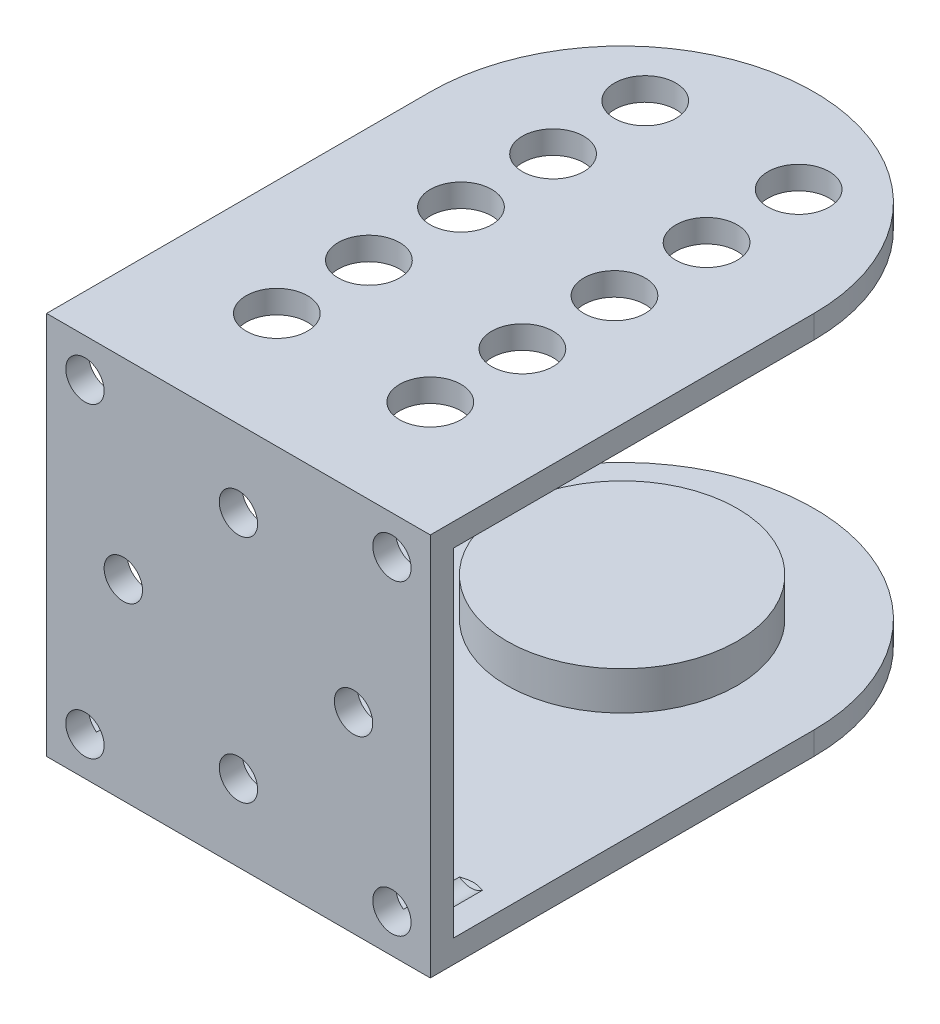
from build123d import *

# Parameters (mm, degrees)
EXTRUDE_THIN1_DEPTH               = 25
F_5_0_5_DIAMETER_HOLE1_D          = 5
F_5_0_5_DIAMETER_HOLE1_DEPTH      = 10.3
F_5_0_5_DIAMETER_HOLE1_TIP        = 1.502151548
FILLET1_RADIUS                    = 25
FILLET1_LENGTH                    = 3
FILLET2_RADIUS                    = 25
FILLET2_LENGTH                    = 3
F_8_0_8_DIAMETER_HOLE1_AT_2_COUNT = 2
F_8_0_8_DIAMETER_HOLE1_AT_2_PITCH = 20
LPATTERN1_COUNT                   = 5
LPATTERN1_PITCH                   = 12
EXTRUDE2_START                    = -8
SKETCH10_R                        = 15
EXTRUDE2_DEPTH                    = 13


with BuildPart() as part:
    # Sketch2 → Extrude-Thin1 (new, symmetric)
    with BuildSketch(Plane(origin=(0, 0, 0), x_dir=(0, 0, -1), z_dir=(1, 0, 0))):
        Polygon((75, 0), (0, 0), (0, 50), (75, 50), (75, 47), (3, 47), (3, 3), (75, 3), align=None)
    extrude(amount=EXTRUDE_THIN1_DEPTH, both=True)

    # 5.0 _5_ Diameter Hole1
    with Locations(Plane.XY):
        with Locations((0, 40), (15, 25), (0, 10), (-15, 25), (-20, 45), (20, 45), (20, 5), (-20, 5)):
            Hole(F_5_0_5_DIAMETER_HOLE1_D / 2, depth=F_5_0_5_DIAMETER_HOLE1_DEPTH)
            with Locations((0, 0, -(F_5_0_5_DIAMETER_HOLE1_DEPTH + F_5_0_5_DIAMETER_HOLE1_TIP / 2))):  # 118° drill point
                Cone(0, F_5_0_5_DIAMETER_HOLE1_D / 2, F_5_0_5_DIAMETER_HOLE1_TIP, mode=Mode.SUBTRACT)

    # Fillet1: full round fillet: the end face becomes a half cylinder, R = half its width
    fillet1_face = Plane((0, 48.5, -75), x_dir=(0, -1, 0), z_dir=(0, 0, -1))  # on the end face: x along it, z out of the body
    fillet1_slab = fillet1_face.offset(-FILLET1_RADIUS / 2) * Box(FILLET1_LENGTH, 2 * FILLET1_RADIUS, FILLET1_RADIUS, mode=Mode.PRIVATE)  # the body's end, R deep
    fillet1_round = Plane((0, 48.5, -50), x_dir=(0, 0, -1), z_dir=(0, -1, 0)) * Cylinder(FILLET1_RADIUS, FILLET1_LENGTH, mode=Mode.PRIVATE)  # its axis R under the face
    add(fillet1_slab - fillet1_round, mode=Mode.SUBTRACT)

    # Fillet2: full round fillet: the end face becomes a half cylinder, R = half its width
    fillet2_face = Plane((0, 1.5, -75), x_dir=(0, -1, 0), z_dir=(0, 0, -1))  # on the end face: x along it, z out of the body
    fillet2_slab = fillet2_face.offset(-FILLET2_RADIUS / 2) * Box(FILLET2_LENGTH, 2 * FILLET2_RADIUS, FILLET2_RADIUS, mode=Mode.PRIVATE)  # the body's end, R deep
    fillet2_round = Plane((0, 1.5, -50), x_dir=(0, 0, -1), z_dir=(0, -1, 0)) * Cylinder(FILLET2_RADIUS, FILLET2_LENGTH, mode=Mode.PRIVATE)  # its axis R under the face
    add(fillet2_slab - fillet2_round, mode=Mode.SUBTRACT)

    # Sketch8 → 8.0 _8_ Diameter Hole1 (revolve, cut)
    with BuildSketch(Plane(origin=(10, 50, -15), x_dir=(0, 0, 1), z_dir=(1, 0, 0))):
        Polygon((0, 0), (0, 12.703442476), (4, 10.3), (4, 0), align=None)
    f_8_0_8_diameter_hole1 = revolve(axis=Axis((10, 56.35, -15), (0, -1, 0)), mode=Mode.SUBTRACT)

    # 8.0 _8_ Diameter Hole1 at 2: 8.0 _8_ Diameter Hole1 ×2
    with Locations(*[(-i * F_8_0_8_DIAMETER_HOLE1_AT_2_PITCH, 0, 0) for i in range(1, F_8_0_8_DIAMETER_HOLE1_AT_2_COUNT)]):
        add(f_8_0_8_diameter_hole1, mode=Mode.SUBTRACT)

    # LPattern1: 8.0 _8_ Diameter Hole1 ×5
    with Locations(*[(0, 0, -i * LPATTERN1_PITCH) for i in range(1, LPATTERN1_COUNT)]):
        add(f_8_0_8_diameter_hole1, mode=Mode.SUBTRACT)

    # LPattern1 copy 1 sketch → LPattern1 copy 1 (revolve, cut)
    with BuildSketch(Plane(origin=(-10, 50, -27), x_dir=(0, 0, 1), z_dir=(1, 0, 0))):
        Polygon((0, 0), (0, 12.703442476), (4, 10.3), (4, 0), align=None)
    revolve(axis=Axis((-10, 56.35, -27), (0, -1, 0)), mode=Mode.SUBTRACT)

    # LPattern1 copy 2 sketch → LPattern1 copy 2 (revolve, cut)
    with BuildSketch(Plane(origin=(-10, 50, -39), x_dir=(0, 0, 1), z_dir=(1, 0, 0))):
        Polygon((0, 0), (0, 12.703442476), (4, 10.3), (4, 0), align=None)
    revolve(axis=Axis((-10, 56.35, -39), (0, -1, 0)), mode=Mode.SUBTRACT)

    # LPattern1 copy 3 sketch → LPattern1 copy 3 (revolve, cut)
    with BuildSketch(Plane(origin=(-10, 50, -51), x_dir=(0, 0, 1), z_dir=(1, 0, 0))):
        Polygon((0, 0), (0, 12.703442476), (4, 10.3), (4, 0), align=None)
    revolve(axis=Axis((-10, 56.35, -51), (0, -1, 0)), mode=Mode.SUBTRACT)

    # LPattern1 copy 4 sketch → LPattern1 copy 4 (revolve, cut)
    with BuildSketch(Plane(origin=(-10, 50, -63), x_dir=(0, 0, 1), z_dir=(1, 0, 0))):
        Polygon((0, 0), (0, 12.703442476), (4, 10.3), (4, 0), align=None)
    revolve(axis=Axis((-10, 56.35, -63), (0, -1, 0)), mode=Mode.SUBTRACT)

    # Sketch10 → Extrude2 (add)
    with BuildSketch(Plane(origin=(0, 3, 0), x_dir=(-1, 0, 0), z_dir=(0, 1, 0)).offset(EXTRUDE2_START)):
        with Locations(Location((0, -50, 0), (0, 0, 270))):
            Circle(SKETCH10_R)
    extrude(amount=EXTRUDE2_DEPTH)


solid = part.part
